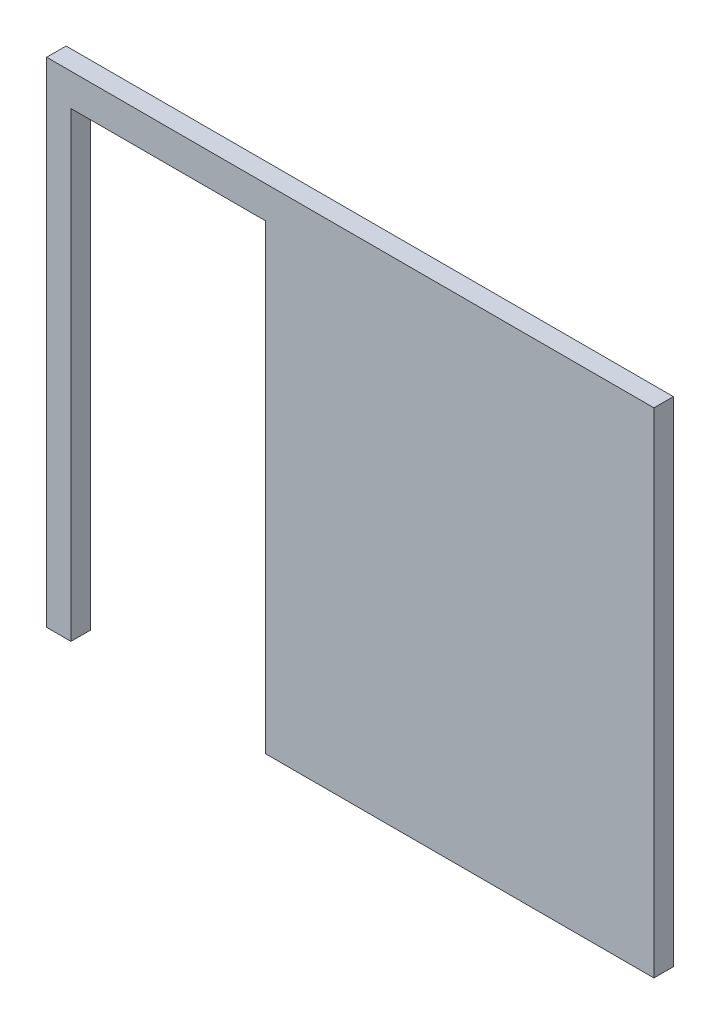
from build123d import *

# Parameters (mm, degrees)
SALIENTE_EXTRUIR2_DEPTH = 80


with BuildPart() as part:
    # Croquis1 → Saliente-Extruir2 (new body)
    with BuildSketch(Plane.XY):
        Polygon((-181.512429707, -1712.219362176), (-281.512429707, -1712.219362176), (-281.512429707, 320.590637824), (2218.487570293, 320.590637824), (2218.487570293, -1712.219362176), (618.487570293, -1712.219362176), (618.487570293, 187.780637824), (-181.512429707, 187.780637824), align=None)
    extrude(amount=SALIENTE_EXTRUIR2_DEPTH)


solid = part.part
